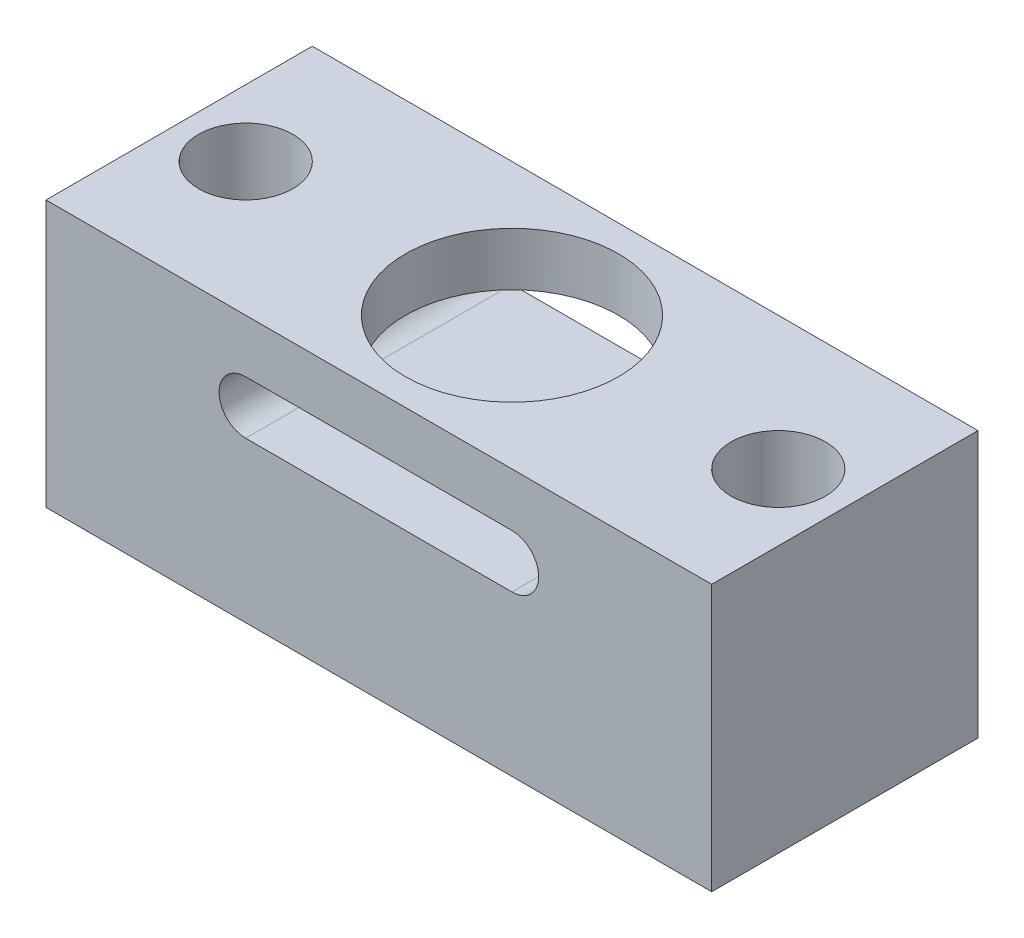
ISO-10303-21;
HEADER;
FILE_DESCRIPTION(('STEP AP214'),'2;1');
FILE_NAME('part.step','',(''),(''),'','','');
FILE_SCHEMA(('AUTOMOTIVE_DESIGN { 1 0 10303 214 1 1 1 1 }'));
ENDSEC;
DATA;
#1=APPLICATION_CONTEXT('core data for automotive mechanical design processes');
#2=APPLICATION_PROTOCOL_DEFINITION('international standard','automotive_design',2000,#1);
#3=PRODUCT_CONTEXT('',#1,'mechanical');
#4=PRODUCT('Part','Part','',(#3));
#5=PRODUCT_RELATED_PRODUCT_CATEGORY('part','',(#4));
#6=PRODUCT_DEFINITION_FORMATION('','',#4);
#7=PRODUCT_DEFINITION_CONTEXT('part definition',#1,'design');
#8=PRODUCT_DEFINITION('design','',#6,#7);
#9=PRODUCT_DEFINITION_SHAPE('','',#8);
#10=(LENGTH_UNIT() NAMED_UNIT(*) SI_UNIT(.MILLI.,.METRE.));
#11=(NAMED_UNIT(*) PLANE_ANGLE_UNIT() SI_UNIT($,.RADIAN.));
#12=(NAMED_UNIT(*) SI_UNIT($,.STERADIAN.) SOLID_ANGLE_UNIT());
#13=UNCERTAINTY_MEASURE_WITH_UNIT(LENGTH_MEASURE(1.E-05),#10,'distance_accuracy_value','');
#14=(GEOMETRIC_REPRESENTATION_CONTEXT(3) GLOBAL_UNCERTAINTY_ASSIGNED_CONTEXT((#13)) GLOBAL_UNIT_ASSIGNED_CONTEXT((#10,
#11,#12)) REPRESENTATION_CONTEXT('',''));
#15=CARTESIAN_POINT('',(0.,0.,0.));
#16=DIRECTION('',(0.,0.,1.));
#17=DIRECTION('',(1.,0.,0.));
#18=AXIS2_PLACEMENT_3D('',#15,#16,#17);
#19=CARTESIAN_POINT('',(-25.7948108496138,7.62,-20.6421767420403));
#20=DIRECTION('',(0.,1.,0.));
#21=DIRECTION('',(0.,0.,1.));
#22=AXIS2_PLACEMENT_3D('',#19,#20,#21);
#23=CYLINDRICAL_SURFACE('',#22,5.08);
#24=CARTESIAN_POINT('',(-25.7948108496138,12.7,-20.6421767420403));
#25=DIRECTION('',(0.,1.,0.));
#26=DIRECTION('',(0.,0.,1.));
#27=AXIS2_PLACEMENT_3D('',#24,#25,#26);
#28=CIRCLE('',#27,5.08);
#29=CARTESIAN_POINT('',(-25.7948108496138,12.7,-15.5621767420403));
#30=VERTEX_POINT('',#29);
#31=EDGE_CURVE('E176',#30,#30,#28,.T.);
#32=ORIENTED_EDGE('',*,*,#31,.T.);
#33=EDGE_LOOP('',(#32));
#34=FACE_BOUND('',#33,.T.);
#35=CARTESIAN_POINT('',(-25.7948108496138,10.16,-20.6421767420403));
#36=DIRECTION('',(0.,-1.,0.));
#37=DIRECTION('',(1.,0.,0.));
#38=AXIS2_PLACEMENT_3D('',#35,#36,#37);
#39=CIRCLE('',#38,5.08);
#40=CARTESIAN_POINT('',(-20.7148108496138,10.16,-20.6421767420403));
#41=VERTEX_POINT('',#40);
#42=EDGE_CURVE('E47',#41,#41,#39,.F.);
#43=ORIENTED_EDGE('',*,*,#42,.F.);
#44=EDGE_LOOP('',(#43));
#45=FACE_BOUND('',#44,.T.);
#46=ADVANCED_FACE('F43',(#34,#45),#23,.F.);
#47=CARTESIAN_POINT('',(-35.3198108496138,12.7,-14.2921767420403));
#48=DIRECTION('',(0.,0.,-1.));
#49=DIRECTION('',(-1.,0.,0.));
#50=AXIS2_PLACEMENT_3D('',#47,#48,#49);
#51=PLANE('',#50);
#52=DIRECTION('',(1.,0.,0.));
#53=VECTOR('',#52,1.);
#54=CARTESIAN_POINT('',(-32.1448108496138,7.62,-14.2921767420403));
#55=LINE('',#54,#53);
#56=CARTESIAN_POINT('',(-32.1448108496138,7.62,-14.2921767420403));
#57=VERTEX_POINT('',#56);
#58=CARTESIAN_POINT('',(-19.4448108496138,7.62,-14.2921767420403));
#59=VERTEX_POINT('',#58);
#60=EDGE_CURVE('E146',#57,#59,#55,.T.);
#61=ORIENTED_EDGE('',*,*,#60,.F.);
#62=CARTESIAN_POINT('',(-32.1448108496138,8.89,-14.2921767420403));
#63=DIRECTION('',(0.,0.,1.));
#64=DIRECTION('',(1.,0.,0.));
#65=AXIS2_PLACEMENT_3D('',#62,#63,#64);
#66=CIRCLE('',#65,1.27);
#67=CARTESIAN_POINT('',(-32.1448108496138,10.16,-14.2921767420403));
#68=VERTEX_POINT('',#67);
#69=EDGE_CURVE('E60',#68,#57,#66,.T.);
#70=ORIENTED_EDGE('',*,*,#69,.F.);
#71=DIRECTION('',(1.,0.,0.));
#72=VECTOR('',#71,1.);
#73=CARTESIAN_POINT('',(-32.1448108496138,10.16,-14.2921767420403));
#74=LINE('',#73,#72);
#75=CARTESIAN_POINT('',(-19.4448108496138,10.16,-14.2921767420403));
#76=VERTEX_POINT('',#75);
#77=EDGE_CURVE('E131',#68,#76,#74,.T.);
#78=ORIENTED_EDGE('',*,*,#77,.T.);
#79=CARTESIAN_POINT('',(-19.4448108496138,8.89,-14.2921767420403));
#80=DIRECTION('',(0.,0.,1.));
#81=DIRECTION('',(1.,0.,0.));
#82=AXIS2_PLACEMENT_3D('',#79,#80,#81);
#83=CIRCLE('',#82,1.27);
#84=EDGE_CURVE('E137',#59,#76,#83,.T.);
#85=ORIENTED_EDGE('',*,*,#84,.F.);
#86=EDGE_LOOP('',(#61,#70,#78,#85));
#87=FACE_BOUND('',#86,.T.);
#88=DIRECTION('',(1.,0.,0.));
#89=VECTOR('',#88,1.);
#90=CARTESIAN_POINT('',(-35.3198108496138,0.,-14.2921767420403));
#91=LINE('',#90,#89);
#92=CARTESIAN_POINT('',(-41.6698108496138,0.,-14.2921767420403));
#93=VERTEX_POINT('',#92);
#94=CARTESIAN_POINT('',(-9.91981084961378,0.,-14.2921767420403));
#95=VERTEX_POINT('',#94);
#96=EDGE_CURVE('E196',#93,#95,#91,.T.);
#97=ORIENTED_EDGE('',*,*,#96,.T.);
#98=DIRECTION('',(0.,-1.,0.));
#99=VECTOR('',#98,1.);
#100=CARTESIAN_POINT('',(-9.91981084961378,12.7,-14.2921767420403));
#101=LINE('',#100,#99);
#102=CARTESIAN_POINT('',(-9.91981084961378,12.7,-14.2921767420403));
#103=VERTEX_POINT('',#102);
#104=EDGE_CURVE('E11',#103,#95,#101,.T.);
#105=ORIENTED_EDGE('',*,*,#104,.F.);
#106=DIRECTION('',(1.,0.,0.));
#107=VECTOR('',#106,1.);
#108=CARTESIAN_POINT('',(-35.3198108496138,12.7,-14.2921767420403));
#109=LINE('',#108,#107);
#110=CARTESIAN_POINT('',(-41.6698108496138,12.7,-14.2921767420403));
#111=VERTEX_POINT('',#110);
#112=EDGE_CURVE('E197',#111,#103,#109,.T.);
#113=ORIENTED_EDGE('',*,*,#112,.F.);
#114=DIRECTION('',(0.,1.,0.));
#115=VECTOR('',#114,1.);
#116=CARTESIAN_POINT('',(-41.6698108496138,12.7,-14.2921767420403));
#117=LINE('',#116,#115);
#118=EDGE_CURVE('E188',#93,#111,#117,.T.);
#119=ORIENTED_EDGE('',*,*,#118,.F.);
#120=EDGE_LOOP('',(#97,#105,#113,#119));
#121=FACE_BOUND('',#120,.T.);
#122=ADVANCED_FACE('F45',(#87,#121),#51,.F.);
#123=CARTESIAN_POINT('',(-9.91981084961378,12.7,-26.9921767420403));
#124=DIRECTION('',(-1.,0.,0.));
#125=DIRECTION('',(0.,0.,1.));
#126=AXIS2_PLACEMENT_3D('',#123,#124,#125);
#127=PLANE('',#126);
#128=DIRECTION('',(0.,0.,-1.));
#129=VECTOR('',#128,1.);
#130=CARTESIAN_POINT('',(-9.91981084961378,0.,-26.9921767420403));
#131=LINE('',#130,#129);
#132=CARTESIAN_POINT('',(-9.91981084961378,0.,-26.9921767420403));
#133=VERTEX_POINT('',#132);
#134=EDGE_CURVE('E209',#95,#133,#131,.T.);
#135=ORIENTED_EDGE('',*,*,#134,.T.);
#136=DIRECTION('',(0.,-1.,0.));
#137=VECTOR('',#136,1.);
#138=CARTESIAN_POINT('',(-9.91981084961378,12.7,-26.9921767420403));
#139=LINE('',#138,#137);
#140=CARTESIAN_POINT('',(-9.91981084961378,12.7,-26.9921767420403));
#141=VERTEX_POINT('',#140);
#142=EDGE_CURVE('E53',#141,#133,#139,.T.);
#143=ORIENTED_EDGE('',*,*,#142,.F.);
#144=DIRECTION('',(0.,0.,-1.));
#145=VECTOR('',#144,1.);
#146=CARTESIAN_POINT('',(-9.91981084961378,12.7,-26.9921767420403));
#147=LINE('',#146,#145);
#148=EDGE_CURVE('E200',#103,#141,#147,.T.);
#149=ORIENTED_EDGE('',*,*,#148,.F.);
#150=ORIENTED_EDGE('',*,*,#104,.T.);
#151=EDGE_LOOP('',(#135,#143,#149,#150));
#152=FACE_BOUND('',#151,.T.);
#153=ADVANCED_FACE('F235',(#152),#127,.F.);
#154=CARTESIAN_POINT('',(-35.3198108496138,12.7,-26.9921767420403));
#155=DIRECTION('',(0.,0.,1.));
#156=DIRECTION('',(1.,0.,0.));
#157=AXIS2_PLACEMENT_3D('',#154,#155,#156);
#158=PLANE('',#157);
#159=DIRECTION('',(1.,0.,0.));
#160=VECTOR('',#159,1.);
#161=CARTESIAN_POINT('',(-32.1448108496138,10.16,-26.9921767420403));
#162=LINE('',#161,#160);
#163=CARTESIAN_POINT('',(-32.1448108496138,10.16,-26.9921767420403));
#164=VERTEX_POINT('',#163);
#165=CARTESIAN_POINT('',(-19.4448108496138,10.16,-26.9921767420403));
#166=VERTEX_POINT('',#165);
#167=EDGE_CURVE('E120',#164,#166,#162,.T.);
#168=ORIENTED_EDGE('',*,*,#167,.F.);
#169=CARTESIAN_POINT('',(-32.1448108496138,8.89,-26.9921767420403));
#170=DIRECTION('',(0.,0.,1.));
#171=DIRECTION('',(1.,0.,0.));
#172=AXIS2_PLACEMENT_3D('',#169,#170,#171);
#173=CIRCLE('',#172,1.27);
#174=CARTESIAN_POINT('',(-32.1448108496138,7.62,-26.9921767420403));
#175=VERTEX_POINT('',#174);
#176=EDGE_CURVE('E113',#164,#175,#173,.T.);
#177=ORIENTED_EDGE('',*,*,#176,.T.);
#178=DIRECTION('',(1.,0.,0.));
#179=VECTOR('',#178,1.);
#180=CARTESIAN_POINT('',(-32.1448108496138,7.62,-26.9921767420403));
#181=LINE('',#180,#179);
#182=CARTESIAN_POINT('',(-19.4448108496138,7.62,-26.9921767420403));
#183=VERTEX_POINT('',#182);
#184=EDGE_CURVE('E123',#175,#183,#181,.T.);
#185=ORIENTED_EDGE('',*,*,#184,.T.);
#186=CARTESIAN_POINT('',(-19.4448108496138,8.89,-26.9921767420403));
#187=DIRECTION('',(0.,0.,1.));
#188=DIRECTION('',(1.,0.,0.));
#189=AXIS2_PLACEMENT_3D('',#186,#187,#188);
#190=CIRCLE('',#189,1.27);
#191=EDGE_CURVE('E68',#183,#166,#190,.T.);
#192=ORIENTED_EDGE('',*,*,#191,.T.);
#193=EDGE_LOOP('',(#168,#177,#185,#192));
#194=FACE_BOUND('',#193,.T.);
#195=DIRECTION('',(-1.,0.,0.));
#196=VECTOR('',#195,1.);
#197=CARTESIAN_POINT('',(-35.3198108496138,0.,-26.9921767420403));
#198=LINE('',#197,#196);
#199=CARTESIAN_POINT('',(-41.6698108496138,0.,-26.9921767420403));
#200=VERTEX_POINT('',#199);
#201=EDGE_CURVE('E201',#133,#200,#198,.T.);
#202=ORIENTED_EDGE('',*,*,#201,.T.);
#203=DIRECTION('',(0.,-1.,0.));
#204=VECTOR('',#203,1.);
#205=CARTESIAN_POINT('',(-41.6698108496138,12.7,-26.9921767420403));
#206=LINE('',#205,#204);
#207=CARTESIAN_POINT('',(-41.6698108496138,12.7,-26.9921767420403));
#208=VERTEX_POINT('',#207);
#209=EDGE_CURVE('E180',#208,#200,#206,.T.);
#210=ORIENTED_EDGE('',*,*,#209,.F.);
#211=DIRECTION('',(-1.,0.,0.));
#212=VECTOR('',#211,1.);
#213=CARTESIAN_POINT('',(-35.3198108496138,12.7,-26.9921767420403));
#214=LINE('',#213,#212);
#215=EDGE_CURVE('E204',#141,#208,#214,.T.);
#216=ORIENTED_EDGE('',*,*,#215,.F.);
#217=ORIENTED_EDGE('',*,*,#142,.T.);
#218=EDGE_LOOP('',(#202,#210,#216,#217));
#219=FACE_BOUND('',#218,.T.);
#220=ADVANCED_FACE('F128',(#194,#219),#158,.F.);
#221=CARTESIAN_POINT('',(0.,12.7,0.));
#222=DIRECTION('',(0.,1.,0.));
#223=DIRECTION('',(0.,0.,1.));
#224=AXIS2_PLACEMENT_3D('',#221,#222,#223);
#225=PLANE('',#224);
#226=CARTESIAN_POINT('',(-38.4948108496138,12.7,-20.6421767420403));
#227=DIRECTION('',(0.,1.,0.));
#228=DIRECTION('',(0.,0.,1.));
#229=AXIS2_PLACEMENT_3D('',#226,#227,#228);
#230=CIRCLE('',#229,2.24789999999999);
#231=CARTESIAN_POINT('',(-38.4948108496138,12.7,-18.3942767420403));
#232=VERTEX_POINT('',#231);
#233=EDGE_CURVE('E160',#232,#232,#230,.T.);
#234=ORIENTED_EDGE('',*,*,#233,.F.);
#235=EDGE_LOOP('',(#234));
#236=FACE_BOUND('',#235,.T.);
#237=CARTESIAN_POINT('',(-13.0948108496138,12.7,-20.6421767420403));
#238=DIRECTION('',(0.,1.,0.));
#239=DIRECTION('',(0.,0.,1.));
#240=AXIS2_PLACEMENT_3D('',#237,#238,#239);
#241=CIRCLE('',#240,2.24789999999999);
#242=CARTESIAN_POINT('',(-13.0948108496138,12.7,-18.3942767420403));
#243=VERTEX_POINT('',#242);
#244=EDGE_CURVE('E168',#243,#243,#241,.T.);
#245=ORIENTED_EDGE('',*,*,#244,.F.);
#246=EDGE_LOOP('',(#245));
#247=FACE_BOUND('',#246,.T.);
#248=ORIENTED_EDGE('',*,*,#31,.F.);
#249=EDGE_LOOP('',(#248));
#250=FACE_BOUND('',#249,.T.);
#251=ORIENTED_EDGE('',*,*,#215,.T.);
#252=DIRECTION('',(0.,0.,-1.));
#253=VECTOR('',#252,1.);
#254=CARTESIAN_POINT('',(-41.6698108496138,12.7,-26.9921767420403));
#255=LINE('',#254,#253);
#256=EDGE_CURVE('E192',#111,#208,#255,.T.);
#257=ORIENTED_EDGE('',*,*,#256,.F.);
#258=ORIENTED_EDGE('',*,*,#112,.T.);
#259=ORIENTED_EDGE('',*,*,#148,.T.);
#260=EDGE_LOOP('',(#251,#257,#258,#259));
#261=FACE_BOUND('',#260,.T.);
#262=ADVANCED_FACE('F233',(#236,#247,#250,#261),#225,.T.);
#263=CARTESIAN_POINT('',(0.,0.,0.));
#264=DIRECTION('',(0.,1.,0.));
#265=DIRECTION('',(0.,0.,1.));
#266=AXIS2_PLACEMENT_3D('',#263,#264,#265);
#267=PLANE('',#266);
#268=CARTESIAN_POINT('',(-38.4948108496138,0.,-20.6421767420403));
#269=DIRECTION('',(0.,1.,0.));
#270=DIRECTION('',(0.,0.,1.));
#271=AXIS2_PLACEMENT_3D('',#268,#269,#270);
#272=CIRCLE('',#271,2.24789999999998);
#273=CARTESIAN_POINT('',(-38.4948108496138,0.,-18.3942767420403));
#274=VERTEX_POINT('',#273);
#275=EDGE_CURVE('E164',#274,#274,#272,.T.);
#276=ORIENTED_EDGE('',*,*,#275,.T.);
#277=EDGE_LOOP('',(#276));
#278=FACE_BOUND('',#277,.T.);
#279=CARTESIAN_POINT('',(-13.0948108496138,0.,-20.6421767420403));
#280=DIRECTION('',(0.,1.,0.));
#281=DIRECTION('',(0.,0.,1.));
#282=AXIS2_PLACEMENT_3D('',#279,#280,#281);
#283=CIRCLE('',#282,2.24789999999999);
#284=CARTESIAN_POINT('',(-13.0948108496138,0.,-18.3942767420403));
#285=VERTEX_POINT('',#284);
#286=EDGE_CURVE('E172',#285,#285,#283,.T.);
#287=ORIENTED_EDGE('',*,*,#286,.T.);
#288=EDGE_LOOP('',(#287));
#289=FACE_BOUND('',#288,.T.);
#290=ORIENTED_EDGE('',*,*,#96,.F.);
#291=DIRECTION('',(0.,0.,1.));
#292=VECTOR('',#291,1.);
#293=CARTESIAN_POINT('',(-41.6698108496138,0.,-26.9921767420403));
#294=LINE('',#293,#292);
#295=EDGE_CURVE('E184',#200,#93,#294,.T.);
#296=ORIENTED_EDGE('',*,*,#295,.F.);
#297=ORIENTED_EDGE('',*,*,#201,.F.);
#298=ORIENTED_EDGE('',*,*,#134,.F.);
#299=EDGE_LOOP('',(#290,#296,#297,#298));
#300=FACE_BOUND('',#299,.T.);
#301=ADVANCED_FACE('F227',(#278,#289,#300),#267,.F.);
#302=CARTESIAN_POINT('',(-41.6698108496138,0.,0.));
#303=DIRECTION('',(-1.,0.,0.));
#304=DIRECTION('',(0.,0.,1.));
#305=AXIS2_PLACEMENT_3D('',#302,#303,#304);
#306=PLANE('',#305);
#307=ORIENTED_EDGE('',*,*,#209,.T.);
#308=ORIENTED_EDGE('',*,*,#295,.T.);
#309=ORIENTED_EDGE('',*,*,#118,.T.);
#310=ORIENTED_EDGE('',*,*,#256,.T.);
#311=EDGE_LOOP('',(#307,#308,#309,#310));
#312=FACE_BOUND('',#311,.T.);
#313=ADVANCED_FACE('F230',(#312),#306,.T.);
#314=CARTESIAN_POINT('',(-13.0948108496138,12.7,-20.6421767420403));
#315=DIRECTION('',(0.,1.,0.));
#316=DIRECTION('',(0.,0.,1.));
#317=AXIS2_PLACEMENT_3D('',#314,#315,#316);
#318=CYLINDRICAL_SURFACE('',#317,2.24789999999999);
#319=ORIENTED_EDGE('',*,*,#286,.F.);
#320=EDGE_LOOP('',(#319));
#321=FACE_BOUND('',#320,.T.);
#322=ORIENTED_EDGE('',*,*,#244,.T.);
#323=EDGE_LOOP('',(#322));
#324=FACE_BOUND('',#323,.T.);
#325=ADVANCED_FACE('F319',(#321,#324),#318,.F.);
#326=CARTESIAN_POINT('',(-38.4948108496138,12.7,-20.6421767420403));
#327=DIRECTION('',(0.,1.,0.));
#328=DIRECTION('',(0.,0.,1.));
#329=AXIS2_PLACEMENT_3D('',#326,#327,#328);
#330=CYLINDRICAL_SURFACE('',#329,2.24789999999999);
#331=ORIENTED_EDGE('',*,*,#275,.F.);
#332=EDGE_LOOP('',(#331));
#333=FACE_BOUND('',#332,.T.);
#334=ORIENTED_EDGE('',*,*,#233,.T.);
#335=EDGE_LOOP('',(#334));
#336=FACE_BOUND('',#335,.T.);
#337=ADVANCED_FACE('F252',(#333,#336),#330,.F.);
#338=CARTESIAN_POINT('',(-32.1448108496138,10.16,-26.9921767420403));
#339=DIRECTION('',(0.,-1.,0.));
#340=DIRECTION('',(1.,0.,0.));
#341=AXIS2_PLACEMENT_3D('',#338,#339,#340);
#342=PLANE('',#341);
#343=ORIENTED_EDGE('',*,*,#77,.F.);
#344=DIRECTION('',(0.,0.,1.));
#345=VECTOR('',#344,1.);
#346=CARTESIAN_POINT('',(-32.1448108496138,10.16,-26.9921767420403));
#347=LINE('',#346,#345);
#348=EDGE_CURVE('E152',#164,#68,#347,.T.);
#349=ORIENTED_EDGE('',*,*,#348,.F.);
#350=ORIENTED_EDGE('',*,*,#167,.T.);
#351=DIRECTION('',(0.,0.,1.));
#352=VECTOR('',#351,1.);
#353=CARTESIAN_POINT('',(-19.4448108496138,10.16,-26.9921767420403));
#354=LINE('',#353,#352);
#355=EDGE_CURVE('E155',#166,#76,#354,.T.);
#356=ORIENTED_EDGE('',*,*,#355,.T.);
#357=EDGE_LOOP('',(#343,#349,#350,#356));
#358=FACE_BOUND('',#357,.T.);
#359=ORIENTED_EDGE('',*,*,#42,.T.);
#360=EDGE_LOOP('',(#359));
#361=FACE_BOUND('',#360,.T.);
#362=ADVANCED_FACE('F249',(#358,#361),#342,.T.);
#363=CARTESIAN_POINT('',(-32.1448108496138,8.89,-26.9921767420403));
#364=DIRECTION('',(0.,0.,1.));
#365=DIRECTION('',(1.,0.,0.));
#366=AXIS2_PLACEMENT_3D('',#363,#364,#365);
#367=CYLINDRICAL_SURFACE('',#366,1.27);
#368=ORIENTED_EDGE('',*,*,#69,.T.);
#369=DIRECTION('',(0.,0.,1.));
#370=VECTOR('',#369,1.);
#371=CARTESIAN_POINT('',(-32.1448108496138,7.62,-26.9921767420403));
#372=LINE('',#371,#370);
#373=EDGE_CURVE('E109',#175,#57,#372,.T.);
#374=ORIENTED_EDGE('',*,*,#373,.F.);
#375=ORIENTED_EDGE('',*,*,#176,.F.);
#376=ORIENTED_EDGE('',*,*,#348,.T.);
#377=EDGE_LOOP('',(#368,#374,#375,#376));
#378=FACE_BOUND('',#377,.T.);
#379=ADVANCED_FACE('F111',(#378),#367,.F.);
#380=CARTESIAN_POINT('',(-19.4448108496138,8.89,-26.9921767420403));
#381=DIRECTION('',(0.,0.,1.));
#382=DIRECTION('',(1.,0.,0.));
#383=AXIS2_PLACEMENT_3D('',#380,#381,#382);
#384=CYLINDRICAL_SURFACE('',#383,1.27);
#385=ORIENTED_EDGE('',*,*,#84,.T.);
#386=ORIENTED_EDGE('',*,*,#355,.F.);
#387=ORIENTED_EDGE('',*,*,#191,.F.);
#388=DIRECTION('',(0.,0.,1.));
#389=VECTOR('',#388,1.);
#390=CARTESIAN_POINT('',(-19.4448108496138,7.62,-26.9921767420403));
#391=LINE('',#390,#389);
#392=EDGE_CURVE('E119',#183,#59,#391,.T.);
#393=ORIENTED_EDGE('',*,*,#392,.T.);
#394=EDGE_LOOP('',(#385,#386,#387,#393));
#395=FACE_BOUND('',#394,.T.);
#396=ADVANCED_FACE('F247',(#395),#384,.F.);
#397=CARTESIAN_POINT('',(-25.7948108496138,7.62,-20.6421767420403));
#398=DIRECTION('',(0.,1.,0.));
#399=DIRECTION('',(0.,0.,1.));
#400=AXIS2_PLACEMENT_3D('',#397,#398,#399);
#401=PLANE('',#400);
#402=ORIENTED_EDGE('',*,*,#60,.T.);
#403=ORIENTED_EDGE('',*,*,#392,.F.);
#404=ORIENTED_EDGE('',*,*,#184,.F.);
#405=ORIENTED_EDGE('',*,*,#373,.T.);
#406=EDGE_LOOP('',(#402,#403,#404,#405));
#407=FACE_BOUND('',#406,.T.);
#408=ADVANCED_FACE('F124',(#407),#401,.T.);
#409=CLOSED_SHELL('',(#46,#122,#153,#220,#262,#301,#313,#325,#337,#362,#379,#396,#408));
#410=MANIFOLD_SOLID_BREP('B2',#409);
#411=ADVANCED_BREP_SHAPE_REPRESENTATION('',(#18,#410),#14);
#412=SHAPE_DEFINITION_REPRESENTATION(#9,#411);
ENDSEC;
END-ISO-10303-21;
